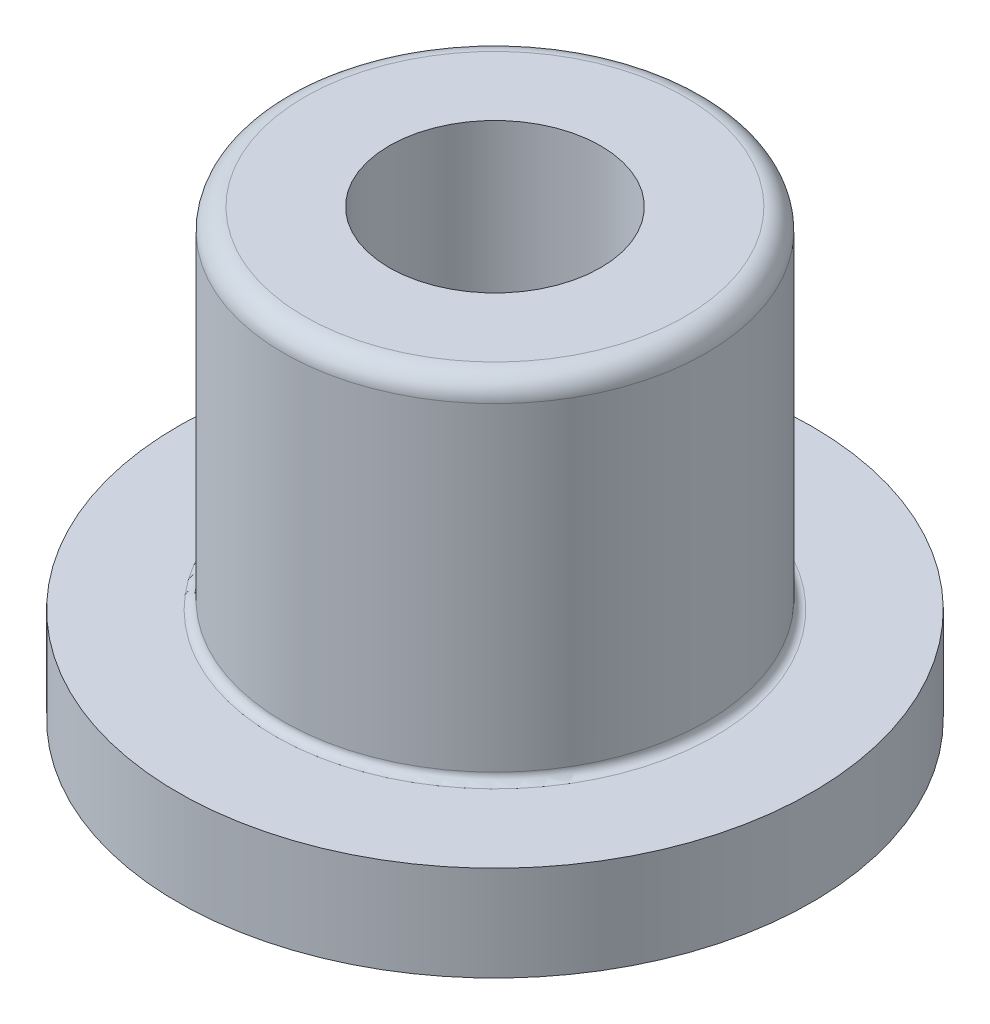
ISO-10303-21;
HEADER;
FILE_DESCRIPTION(('STEP AP214'),'2;1');
FILE_NAME('part.step','',(''),(''),'','','');
FILE_SCHEMA(('AUTOMOTIVE_DESIGN { 1 0 10303 214 1 1 1 1 }'));
ENDSEC;
DATA;
#1=APPLICATION_CONTEXT('core data for automotive mechanical design processes');
#2=APPLICATION_PROTOCOL_DEFINITION('international standard','automotive_design',2000,#1);
#3=PRODUCT_CONTEXT('',#1,'mechanical');
#4=PRODUCT('Part','Part','',(#3));
#5=PRODUCT_RELATED_PRODUCT_CATEGORY('part','',(#4));
#6=PRODUCT_DEFINITION_FORMATION('','',#4);
#7=PRODUCT_DEFINITION_CONTEXT('part definition',#1,'design');
#8=PRODUCT_DEFINITION('design','',#6,#7);
#9=PRODUCT_DEFINITION_SHAPE('','',#8);
#10=(LENGTH_UNIT() NAMED_UNIT(*) SI_UNIT(.MILLI.,.METRE.));
#11=(NAMED_UNIT(*) PLANE_ANGLE_UNIT() SI_UNIT($,.RADIAN.));
#12=(NAMED_UNIT(*) SI_UNIT($,.STERADIAN.) SOLID_ANGLE_UNIT());
#13=UNCERTAINTY_MEASURE_WITH_UNIT(LENGTH_MEASURE(1.E-05),#10,'distance_accuracy_value','');
#14=(GEOMETRIC_REPRESENTATION_CONTEXT(3) GLOBAL_UNCERTAINTY_ASSIGNED_CONTEXT((#13)) GLOBAL_UNIT_ASSIGNED_CONTEXT((#10,
#11,#12)) REPRESENTATION_CONTEXT('',''));
#15=CARTESIAN_POINT('',(0.,0.,0.));
#16=DIRECTION('',(0.,0.,1.));
#17=DIRECTION('',(1.,0.,0.));
#18=AXIS2_PLACEMENT_3D('',#15,#16,#17);
#19=CARTESIAN_POINT('',(0.,10.5,0.));
#20=DIRECTION('',(0.,-1.,0.));
#21=DIRECTION('',(0.,0.,-1.));
#22=AXIS2_PLACEMENT_3D('',#19,#20,#21);
#23=CYLINDRICAL_SURFACE('',#22,10.);
#24=CARTESIAN_POINT('',(0.,20.,0.));
#25=DIRECTION('',(0.,-1.,0.));
#26=DIRECTION('',(-0.479425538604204,0.,0.877582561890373));
#27=AXIS2_PLACEMENT_3D('',#24,#25,#26);
#28=CIRCLE('',#27,10.);
#29=CARTESIAN_POINT('',(-4.79425538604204,20.,8.77582561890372));
#30=VERTEX_POINT('',#29);
#31=EDGE_CURVE('E53',#30,#30,#28,.F.);
#32=ORIENTED_EDGE('',*,*,#31,.F.);
#33=EDGE_LOOP('',(#32));
#34=FACE_BOUND('',#33,.T.);
#35=CARTESIAN_POINT('',(0.,4.9,0.));
#36=DIRECTION('',(0.,-1.,0.));
#37=DIRECTION('',(0.197991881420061,0.,-0.9802036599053));
#38=AXIS2_PLACEMENT_3D('',#35,#36,#37);
#39=CIRCLE('',#38,10.);
#40=CARTESIAN_POINT('',(1.9799188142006,4.9,-9.80203659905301));
#41=VERTEX_POINT('',#40);
#42=EDGE_CURVE('E198',#41,#41,#39,.F.);
#43=ORIENTED_EDGE('',*,*,#42,.T.);
#44=EDGE_LOOP('',(#43));
#45=FACE_BOUND('',#44,.T.);
#46=ADVANCED_FACE('F17',(#34,#45),#23,.T.);
#47=CARTESIAN_POINT('',(0.,4.9,0.));
#48=DIRECTION('',(0.,-1.,0.));
#49=DIRECTION('',(0.197991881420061,0.,-0.9802036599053));
#50=AXIS2_PLACEMENT_3D('',#47,#48,#49);
#51=TOROIDAL_SURFACE('',#50,10.4,0.4);
#52=ORIENTED_EDGE('',*,*,#42,.F.);
#53=EDGE_LOOP('',(#52));
#54=FACE_BOUND('',#53,.T.);
#55=CARTESIAN_POINT('',(0.,4.5,0.));
#56=DIRECTION('',(0.,1.,0.));
#57=DIRECTION('',(-0.479425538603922,0.,0.877582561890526));
#58=AXIS2_PLACEMENT_3D('',#55,#56,#57);
#59=CIRCLE('',#58,10.3999999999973);
#60=CARTESIAN_POINT('',(-4.98602560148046,4.5,9.12685864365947));
#61=VERTEX_POINT('',#60);
#62=CARTESIAN_POINT('',(4.98602580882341,4.5,-9.12685853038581));
#63=VERTEX_POINT('',#62);
#64=EDGE_CURVE('E46',#61,#63,#59,.T.);
#65=ORIENTED_EDGE('',*,*,#64,.T.);
#66=CARTESIAN_POINT('',(4.98602594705,4.5,-9.12685845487));
#67=CARTESIAN_POINT('',(4.83668965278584,4.5,-9.2084453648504));
#68=CARTESIAN_POINT('',(4.6853478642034,4.5,-9.28636060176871));
#69=CARTESIAN_POINT('',(4.37902480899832,4.5,-9.43467430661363));
#70=CARTESIAN_POINT('',(4.22404354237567,4.5,-9.50507277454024));
#71=CARTESIAN_POINT('',(3.91081304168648,4.5,-9.63817951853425));
#72=CARTESIAN_POINT('',(3.75256380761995,4.5,-9.70088779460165));
#73=CARTESIAN_POINT('',(3.43317910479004,4.5,-9.8184641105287));
#74=CARTESIAN_POINT('',(3.27204363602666,4.5,-9.87333215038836));
#75=CARTESIAN_POINT('',(2.94727452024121,4.5,-9.97509553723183));
#76=CARTESIAN_POINT('',(2.78364087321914,4.5,-10.0219908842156));
#77=CARTESIAN_POINT('',(2.45426964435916,4.5,-10.1076959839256));
#78=CARTESIAN_POINT('',(2.28853206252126,4.5,-10.1465057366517));
#79=CARTESIAN_POINT('',(1.95535223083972,4.5,-10.2159461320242));
#80=CARTESIAN_POINT('',(1.78790998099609,4.5,-10.2465767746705));
#81=CARTESIAN_POINT('',(1.4517241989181,4.5,-10.2995851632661));
#82=CARTESIAN_POINT('',(1.28298066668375,4.5,-10.3219629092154));
#83=CARTESIAN_POINT('',(0.944598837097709,4.5,-10.3584115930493));
#84=CARTESIAN_POINT('',(0.774960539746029,4.5,-10.372482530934));
#85=CARTESIAN_POINT('',(0.435197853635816,4.5,-10.3922837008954));
#86=CARTESIAN_POINT('',(0.265073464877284,4.5,-10.3980139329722));
#87=CARTESIAN_POINT('',(-0.0752515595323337,4.5,-10.401119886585));
#88=CARTESIAN_POINT('',(-0.245452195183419,4.5,-10.398495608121));
#89=CARTESIAN_POINT('',(-0.585519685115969,4.5,-10.3848988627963));
#90=CARTESIAN_POINT('',(-0.755386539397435,4.5,-10.3739263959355));
#91=CARTESIAN_POINT('',(-1.09437724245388,4.5,-10.3436597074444));
#92=CARTESIAN_POINT('',(-1.26350109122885,4.5,-10.324365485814));
#93=CARTESIAN_POINT('',(-1.60059834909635,4.5,-10.2775017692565));
#94=CARTESIAN_POINT('',(-1.76857175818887,4.5,-10.2499322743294));
#95=CARTESIAN_POINT('',(-2.10296347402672,4.5,-10.1865844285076));
#96=CARTESIAN_POINT('',(-2.26938178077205,4.5,-10.1508060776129));
#97=CARTESIAN_POINT('',(-2.60026237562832,4.5,-10.0711267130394));
#98=CARTESIAN_POINT('',(-2.76472466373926,4.5,-10.0272256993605));
#99=CARTESIAN_POINT('',(-3.09129701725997,4.5,-9.93140677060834));
#100=CARTESIAN_POINT('',(-3.25340708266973,4.5,-9.87948885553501));
#101=CARTESIAN_POINT('',(-3.57488445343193,4.5,-9.76776119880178));
#102=CARTESIAN_POINT('',(-3.73425175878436,4.5,-9.70795145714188));
#103=CARTESIAN_POINT('',(-4.04985967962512,4.5,-9.58058423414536));
#104=CARTESIAN_POINT('',(-4.20610029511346,4.5,-9.51302675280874));
#105=CARTESIAN_POINT('',(-4.51507843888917,4.5,-9.37032680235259));
#106=CARTESIAN_POINT('',(-4.66781596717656,4.5,-9.29518433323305));
#107=CARTESIAN_POINT('',(-4.96941997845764,4.5,-9.13749543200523));
#108=CARTESIAN_POINT('',(-5.11828646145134,4.5,-9.05494899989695));
#109=CARTESIAN_POINT('',(-5.41178974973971,4.5,-8.88265103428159));
#110=CARTESIAN_POINT('',(-5.55642655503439,4.5,-8.79289950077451));
#111=CARTESIAN_POINT('',(-5.84112204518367,4.5,-8.60640755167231));
#112=CARTESIAN_POINT('',(-5.98118073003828,4.5,-8.50966713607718));
#113=CARTESIAN_POINT('',(-6.2563825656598,4.5,-8.30943047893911));
#114=CARTESIAN_POINT('',(-6.3915257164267,4.5,-8.20593423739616));
#115=CARTESIAN_POINT('',(-6.65657091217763,4.5,-7.99243525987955));
#116=CARTESIAN_POINT('',(-6.78647295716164,4.5,-7.88243252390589));
#117=CARTESIAN_POINT('',(-7.04072299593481,4.5,-7.65618556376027));
#118=CARTESIAN_POINT('',(-7.16507098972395,4.5,-7.53994133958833));
#119=CARTESIAN_POINT('',(-7.40791336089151,4.5,-7.30149144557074));
#120=CARTESIAN_POINT('',(-7.52640773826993,4.5,-7.17928577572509));
#121=CARTESIAN_POINT('',(-7.75725741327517,4.5,-6.92920739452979));
#122=CARTESIAN_POINT('',(-7.86961271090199,4.5,-6.80133468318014));
#123=CARTESIAN_POINT('',(-8.08791355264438,4.5,-6.54023027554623));
#124=CARTESIAN_POINT('',(-8.19385909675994,4.5,-6.40699857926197));
#125=CARTESIAN_POINT('',(-8.39908519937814,4.5,-6.13549716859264));
#126=CARTESIAN_POINT('',(-8.49836575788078,4.5,-5.99722745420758));
#127=CARTESIAN_POINT('',(-8.69002271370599,4.5,-5.71598311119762));
#128=CARTESIAN_POINT('',(-8.78239911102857,4.5,-5.57300848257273));
#129=CARTESIAN_POINT('',(-8.96002520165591,4.5,-5.28269874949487));
#130=CARTESIAN_POINT('',(-9.04527489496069,4.5,-5.13536364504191));
#131=CARTESIAN_POINT('',(-9.20844220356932,4.5,-4.83668790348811));
#132=CARTESIAN_POINT('',(-9.28635981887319,4.5,-4.68534726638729));
#133=CARTESIAN_POINT('',(-9.43467526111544,4.5,-4.37902505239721));
#134=CARTESIAN_POINT('',(-9.50507308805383,4.5,-4.22404347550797));
#135=CARTESIAN_POINT('',(-9.63817935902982,4.5,-3.91081274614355));
#136=CARTESIAN_POINT('',(-9.70088780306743,4.5,-3.75256359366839));
#137=CARTESIAN_POINT('',(-9.81846423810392,4.5,-3.43317894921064));
#138=CARTESIAN_POINT('',(-9.8733322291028,4.5,-3.27204345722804));
#139=CARTESIAN_POINT('',(-9.97509557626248,4.5,-2.94727432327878));
#140=CARTESIAN_POINT('',(-10.0219909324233,4.5,-2.7836406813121));
#141=CARTESIAN_POINT('',(-10.1076960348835,4.5,-2.45426945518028));
#142=CARTESIAN_POINT('',(-10.146505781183,4.5,-2.28853187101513));
#143=CARTESIAN_POINT('',(-10.2159461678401,4.5,-1.95535203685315));
#144=CARTESIAN_POINT('',(-10.2465768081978,4.5,-1.7879097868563));
#145=CARTESIAN_POINT('',(-10.299585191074,4.5,-1.45172400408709));
#146=CARTESIAN_POINT('',(-10.3219629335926,4.5,-1.28298047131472));
#147=CARTESIAN_POINT('',(-10.3584116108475,4.5,-0.944598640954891));
#148=CARTESIAN_POINT('',(-10.3724825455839,4.5,-0.774960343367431));
#149=CARTESIAN_POINT('',(-10.3922837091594,4.5,-0.435197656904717));
#150=CARTESIAN_POINT('',(-10.3980139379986,4.5,-0.265073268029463));
#151=CARTESIAN_POINT('',(-10.4011198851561,4.5,0.0752517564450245));
#152=CARTESIAN_POINT('',(-10.3984956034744,4.5,0.245452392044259));
#153=CARTESIAN_POINT('',(-10.384898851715,4.5,0.585519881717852));
#154=CARTESIAN_POINT('',(-10.3739263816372,4.5,0.755386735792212));
#155=CARTESIAN_POINT('',(-10.3436596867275,4.5,1.09437743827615));
#156=CARTESIAN_POINT('',(-10.3243654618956,4.5,1.26350128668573));
#157=CARTESIAN_POINT('',(-10.2775017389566,4.5,1.60059854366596));
#158=CARTESIAN_POINT('',(-10.2499322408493,4.5,1.76857195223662));
#159=CARTESIAN_POINT('',(-10.1865843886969,4.5,2.10296366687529));
#160=CARTESIAN_POINT('',(-10.1508060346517,4.5,2.2693819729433));
#161=CARTESIAN_POINT('',(-10.0711266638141,4.5,2.60026256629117));
#162=CARTESIAN_POINT('',(-10.0272256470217,4.5,2.76472485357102));
#163=CARTESIAN_POINT('',(-9.93140671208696,4.5,3.09129720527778));
#164=CARTESIAN_POINT('',(-9.87948879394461,4.5,3.25340726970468));
#165=CARTESIAN_POINT('',(-9.76776113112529,4.5,3.57488463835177));
#166=CARTESIAN_POINT('',(-9.70795138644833,4.5,3.73425194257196));
#167=CARTESIAN_POINT('',(-9.58058415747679,4.5,4.04985986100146));
#168=CARTESIAN_POINT('',(-9.51302667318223,4.5,4.20610047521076));
#169=CARTESIAN_POINT('',(-9.37032671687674,4.5,4.51507861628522));
#170=CARTESIAN_POINT('',(-9.29518424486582,4.5,4.66781614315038));
#171=CARTESIAN_POINT('',(-9.13749533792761,4.5,4.96942015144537));
#172=CARTESIAN_POINT('',(-9.05494890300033,4.5,5.11828663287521));
#173=CARTESIAN_POINT('',(-8.88265093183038,4.5,5.41178991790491));
#174=CARTESIAN_POINT('',(-8.79289939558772,4.5,5.55642672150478));
#175=CARTESIAN_POINT('',(-8.60640744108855,4.5,5.84112220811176));
#176=CARTESIAN_POINT('',(-8.50966702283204,4.5,5.98118089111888));
#177=CARTESIAN_POINT('',(-8.30943036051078,4.5,6.25638272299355));
#178=CARTESIAN_POINT('',(-8.20593411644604,4.5,6.3915258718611));
#179=CARTESIAN_POINT('',(-7.99243513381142,4.5,6.65657106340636));
#180=CARTESIAN_POINT('',(-7.88243239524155,4.5,6.78647310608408));
#181=CARTESIAN_POINT('',(-7.65618543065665,4.5,7.0407231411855));
#182=CARTESIAN_POINT('',(-7.53994120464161,4.5,7.1650711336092));
#183=CARTESIAN_POINT('',(-7.30149130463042,4.5,7.4079134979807));
#184=CARTESIAN_POINT('',(-7.17928563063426,4.5,7.52640786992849));
#185=CARTESIAN_POINT('',(-6.92920725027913,4.5,7.75725754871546));
#186=CARTESIAN_POINT('',(-6.80133454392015,4.5,7.86961285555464));
#187=CARTESIAN_POINT('',(-6.54023011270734,4.5,8.08791366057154));
#188=CARTESIAN_POINT('',(-6.4069983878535,4.5,8.19385915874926));
#189=CARTESIAN_POINT('',(-6.13549704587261,4.5,8.39908537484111));
#190=CARTESIAN_POINT('',(-5.99722742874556,4.5,8.49836609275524));
#191=CARTESIAN_POINT('',(-5.7159828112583,4.5,8.69002260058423));
#192=CARTESIAN_POINT('',(-5.57300781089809,4.5,8.7823983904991));
#193=CARTESIAN_POINT('',(-5.28269908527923,4.5,8.96002612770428));
#194=CARTESIAN_POINT('',(-5.13536536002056,4.5,9.0452780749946));
#195=CARTESIAN_POINT('',(-4.98602560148,4.5,9.12685864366));
#196=B_SPLINE_CURVE_WITH_KNOTS('',3,(#66,#67,#68,#69,#70,#71,#72,#73,#74,#75,#76,#77,#78,#79,
#80,#81,#82,#83,#84,#85,#86,#87,#88,#89,#90,#91,#92,#93,#94,#95,#96,#97,#98,#99,#100,#101,#102,
#103,#104,#105,#106,#107,#108,#109,#110,#111,#112,#113,#114,#115,#116,#117,#118,#119,#120,#121,
#122,#123,#124,#125,#126,#127,#128,#129,#130,#131,#132,#133,#134,#135,#136,#137,#138,#139,#140,
#141,#142,#143,#144,#145,#146,#147,#148,#149,#150,#151,#152,#153,#154,#155,#156,#157,#158,#159,
#160,#161,#162,#163,#164,#165,#166,#167,#168,#169,#170,#171,#172,#173,#174,#175,#176,#177,#178,
#179,#180,#181,#182,#183,#184,#185,#186,#187,#188,#189,#190,#191,#192,#193,#194,#195),
.UNSPECIFIED.,.F.,.F.,(4,2,2,2,2,2,2,2,2,2,2,2,2,2,2,2,2,2,2,2,2,2,2,2,2,2,2,2,2,2,2,2,2,2,2,2,
2,2,2,2,2,2,2,2,2,2,2,2,2,2,2,2,2,2,2,2,2,2,2,2,2,2,2,2,4),(0.,0.510457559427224,
1.02091511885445,1.53137267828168,2.04183023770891,2.55228779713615,3.06274535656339,
3.57320291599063,4.08366047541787,4.59411803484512,5.10457559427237,5.61503315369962,
6.12549071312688,6.63594827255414,7.1464058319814,7.65686339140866,8.16732095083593,
8.6777785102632,9.18823606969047,9.69869362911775,10.209151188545,10.7196087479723,
11.2300663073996,11.7405238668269,12.2509814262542,12.7614389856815,13.2718965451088,
13.7823541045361,14.2928116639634,14.8032692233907,15.313726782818,15.8241843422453,
16.3346419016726,16.8450994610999,17.3555570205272,17.8660145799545,18.3764721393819,
18.8869296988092,19.3973872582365,19.9078448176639,20.4183023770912,20.9287599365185,
21.4392174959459,21.9496750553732,22.4601326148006,22.9705901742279,23.4810477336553,
23.9915052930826,24.50196285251,25.0124204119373,25.5228779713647,26.0333355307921,
26.5437930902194,27.0542506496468,27.5647082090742,28.0751657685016,28.585623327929,
29.0960808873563,29.6065384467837,30.1169960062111,30.6274535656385,31.1379111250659,
31.6483686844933,32.1588262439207,32.6692838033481),.UNSPECIFIED.);
#197=EDGE_CURVE('E49',#63,#61,#196,.T.);
#198=ORIENTED_EDGE('',*,*,#197,.T.);
#199=EDGE_LOOP('',(#65,#198));
#200=FACE_BOUND('',#199,.T.);
#201=ADVANCED_FACE('F50',(#54,#200),#51,.F.);
#202=CARTESIAN_POINT('',(0.,20.,0.));
#203=DIRECTION('',(0.,-1.,0.));
#204=DIRECTION('',(-0.479425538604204,0.,0.877582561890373));
#205=AXIS2_PLACEMENT_3D('',#202,#203,#204);
#206=TOROIDAL_SURFACE('',#205,9.,1.);
#207=CARTESIAN_POINT('',(4.31482979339,21.,-7.89824308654));
#208=CARTESIAN_POINT('',(4.44406612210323,21.,-7.82764451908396));
#209=CARTESIAN_POINT('',(4.57156646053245,21.,-7.75386879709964));
#210=CARTESIAN_POINT('',(4.82279516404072,21.,-7.60015248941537));
#211=CARTESIAN_POINT('',(4.94652352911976,21.,-7.52021190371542));
#212=CARTESIAN_POINT('',(5.18990829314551,21.,-7.35435531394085));
#213=CARTESIAN_POINT('',(5.30956469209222,21.,-7.26843930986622));
#214=CARTESIAN_POINT('',(5.54451777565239,21.,-7.09083970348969));
#215=CARTESIAN_POINT('',(5.65981446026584,21.,-6.99915610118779));
#216=CARTESIAN_POINT('',(5.88577021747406,21.,-6.81024194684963));
#217=CARTESIAN_POINT('',(5.99642929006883,21.,-6.71301139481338));
#218=CARTESIAN_POINT('',(6.21284327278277,21.,-6.51323763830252));
#219=CARTESIAN_POINT('',(6.31859818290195,21.,-6.41069443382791));
#220=CARTESIAN_POINT('',(6.52494905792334,21.,-6.20054239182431));
#221=CARTESIAN_POINT('',(6.62554502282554,21.,-6.0929335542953));
#222=CARTESIAN_POINT('',(6.82133566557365,21.,-5.87290948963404));
#223=CARTESIAN_POINT('',(6.91653034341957,21.,-5.76049426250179));
#224=CARTESIAN_POINT('',(7.10128907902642,21.,-5.53112823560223));
#225=CARTESIAN_POINT('',(7.19085313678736,21.,-5.41417743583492));
#226=CARTESIAN_POINT('',(7.36413486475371,21.,-5.17602200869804));
#227=CARTESIAN_POINT('',(7.44785253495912,21.,-5.05481738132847));
#228=CARTESIAN_POINT('',(7.60923980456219,21.,-4.80844629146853));
#229=CARTESIAN_POINT('',(7.68690940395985,21.,-4.68327982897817));
#230=CARTESIAN_POINT('',(7.83601341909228,21.,-4.42928660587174));
#231=CARTESIAN_POINT('',(7.90744783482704,21.,-4.30045984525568));
#232=CARTESIAN_POINT('',(8.04390939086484,21.,-4.03945638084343));
#233=CARTESIAN_POINT('',(8.10893653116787,21.,-3.90727967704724));
#234=CARTESIAN_POINT('',(8.23242688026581,21.,-3.6398947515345));
#235=CARTESIAN_POINT('',(8.29089008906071,21.,-3.50468652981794));
#236=CARTESIAN_POINT('',(8.40111173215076,21.,-3.23156429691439));
#237=CARTESIAN_POINT('',(8.4528701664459,21.,-3.0936502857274));
#238=CARTESIAN_POINT('',(8.54955756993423,21.,-2.81544872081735));
#239=CARTESIAN_POINT('',(8.59448653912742,21.,-2.67516116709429));
#240=CARTESIAN_POINT('',(8.67740677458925,21.,-2.39255048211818));
#241=CARTESIAN_POINT('',(8.71539804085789,21.,-2.25022735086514));
#242=CARTESIAN_POINT('',(8.78435134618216,21.,-1.9638883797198));
#243=CARTESIAN_POINT('',(8.81531338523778,21.,-1.81987253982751));
#244=CARTESIAN_POINT('',(8.87013364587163,21.,-1.53049509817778));
#245=CARTESIAN_POINT('',(8.89399186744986,21.,-1.38513349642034));
#246=CARTESIAN_POINT('',(8.93454701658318,21.,-1.09341471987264));
#247=CARTESIAN_POINT('',(8.95124394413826,21.,-0.947057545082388));
#248=CARTESIAN_POINT('',(8.97743628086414,21.,-0.653700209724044));
#249=CARTESIAN_POINT('',(8.98693169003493,21.,-0.506700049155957));
#250=CARTESIAN_POINT('',(8.99869811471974,21.,-0.212410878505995));
#251=CARTESIAN_POINT('',(9.00096913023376,21.,-0.0651218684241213));
#252=CARTESIAN_POINT('',(8.99828129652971,21.,0.229390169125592));
#253=CARTESIAN_POINT('',(8.99332244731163,21.,0.376613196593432));
#254=CARTESIAN_POINT('',(8.97618683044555,21.,0.670638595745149));
#255=CARTESIAN_POINT('',(8.96401006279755,21.,0.817440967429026));
#256=CARTESIAN_POINT('',(8.93246794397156,21.,1.11027139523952));
#257=CARTESIAN_POINT('',(8.91310259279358,21.,1.25629945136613));
#258=CARTESIAN_POINT('',(8.86722995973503,21.,1.5472294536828));
#259=CARTESIAN_POINT('',(8.84072267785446,21.,1.69213139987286));
#260=CARTESIAN_POINT('',(8.78063004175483,21.,1.98046010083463));
#261=CARTESIAN_POINT('',(8.74704468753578,21.,2.12388685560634));
#262=CARTESIAN_POINT('',(8.67287681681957,21.,2.40891964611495));
#263=CARTESIAN_POINT('',(8.63229430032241,21.,2.55052568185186));
#264=CARTESIAN_POINT('',(8.54422987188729,21.,2.83157589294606));
#265=CARTESIAN_POINT('',(8.49674795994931,21.,2.97102006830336));
#266=CARTESIAN_POINT('',(8.39499912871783,21.,3.24741062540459));
#267=CARTESIAN_POINT('',(8.34073220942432,21.,3.38435700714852));
#268=CARTESIAN_POINT('',(8.22554409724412,21.,3.65542206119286));
#269=CARTESIAN_POINT('',(8.16462290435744,21.,3.78954073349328));
#270=CARTESIAN_POINT('',(8.03627300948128,21.,4.05462726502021));
#271=CARTESIAN_POINT('',(7.96884430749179,21.,4.18559512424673));
#272=CARTESIAN_POINT('',(7.82764183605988,21.,4.44406451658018));
#273=CARTESIAN_POINT('',(7.75386806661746,21.,4.57156604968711));
#274=CARTESIAN_POINT('',(7.60015318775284,21.,4.82279562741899));
#275=CARTESIAN_POINT('',(7.52021207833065,21.,4.94652367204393));
#276=CARTESIAN_POINT('',(7.35435510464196,21.,5.18990820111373));
#277=CARTESIAN_POINT('',(7.26843924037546,21.,5.30956468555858));
#278=CARTESIAN_POINT('',(7.0908397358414,21.,5.54451783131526));
#279=CARTESIAN_POINT('',(6.99915609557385,21.,5.65981449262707));
#280=CARTESIAN_POINT('',(6.81024191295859,21.,5.88577023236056));
#281=CARTESIAN_POINT('',(6.71301137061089,21.,5.99642931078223));
#282=CARTESIAN_POINT('',(6.51323762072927,21.,6.21284329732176));
#283=CARTESIAN_POINT('',(6.41069441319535,21.,6.31859820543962));
#284=CARTESIAN_POINT('',(6.20054236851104,21.,6.52494907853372));
#285=CARTESIAN_POINT('',(6.09293353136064,21.,6.62554504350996));
#286=CARTESIAN_POINT('',(5.87290946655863,21.,6.82133568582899));
#287=CARTESIAN_POINT('',(5.760494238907,21.,6.91653036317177));
#288=CARTESIAN_POINT('',(5.53112821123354,21.,7.10128909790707));
#289=CARTESIAN_POINT('',(5.4141774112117,21.,7.19085315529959));
#290=CARTESIAN_POINT('',(5.17602198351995,21.,7.36413488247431));
#291=CARTESIAN_POINT('',(5.05481735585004,21.,7.44785255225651));
#292=CARTESIAN_POINT('',(4.80844626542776,21.,7.60923982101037));
#293=CARTESIAN_POINT('',(4.68327980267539,21.,7.68690941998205));
#294=CARTESIAN_POINT('',(4.42928657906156,21.,7.83601343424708));
#295=CARTESIAN_POINT('',(4.3004598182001,21.,7.90744784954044));
#296=CARTESIAN_POINT('',(4.03945635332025,21.,8.04390940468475));
#297=CARTESIAN_POINT('',(3.90727964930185,21.,8.10893654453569));
#298=CARTESIAN_POINT('',(3.6398947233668,21.,8.23242689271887));
#299=CARTESIAN_POINT('',(3.50468650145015,21.,8.29089010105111));
#300=CARTESIAN_POINT('',(3.23156426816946,21.,8.40111174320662));
#301=CARTESIAN_POINT('',(3.09365025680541,21.,8.4528701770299));
#302=CARTESIAN_POINT('',(2.81544869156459,21.,8.54955757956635));
#303=CARTESIAN_POINT('',(2.67516113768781,21.,8.59448654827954));
#304=CARTESIAN_POINT('',(2.39255045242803,21.,8.6774067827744));
#305=CARTESIAN_POINT('',(2.25022732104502,21.,8.71539804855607));
#306=CARTESIAN_POINT('',(1.96388834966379,21.,8.78435135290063));
#307=CARTESIAN_POINT('',(1.81987250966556,21.,8.81531339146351));
#308=CARTESIAN_POINT('',(1.53049506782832,21.,8.8701336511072));
#309=CARTESIAN_POINT('',(1.3851334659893,21.,8.89399187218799));
#310=CARTESIAN_POINT('',(1.09341468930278,21.,8.93454702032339));
#311=CARTESIAN_POINT('',(0.947057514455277,21.,8.95124394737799));
#312=CARTESIAN_POINT('',(0.653700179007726,21.,8.97743628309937));
#313=CARTESIAN_POINT('',(0.506700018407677,21.,8.98693169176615));
#314=CARTESIAN_POINT('',(0.212410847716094,21.,8.99869811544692));
#315=CARTESIAN_POINT('',(0.0651218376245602,21.,9.00096913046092));
#316=CARTESIAN_POINT('',(-0.229390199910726,21.,8.99828129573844));
#317=CARTESIAN_POINT('',(-0.376613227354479,21.,8.99332244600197));
#318=CARTESIAN_POINT('',(-0.670638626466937,21.,8.97618682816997));
#319=CARTESIAN_POINT('',(-0.817440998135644,21.,8.96401006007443));
#320=CARTESIAN_POINT('',(-1.11027142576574,21.,8.93246794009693));
#321=CARTESIAN_POINT('',(-1.25629948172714,21.,8.91310258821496));
#322=CARTESIAN_POINT('',(-1.54722948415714,21.,8.8672299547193));
#323=CARTESIAN_POINT('',(-1.69213143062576,21.,8.84072267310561));
#324=CARTESIAN_POINT('',(-1.98046013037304,21.,8.78063003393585));
#325=CARTESIAN_POINT('',(-2.12388688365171,21.,8.74704467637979));
#326=CARTESIAN_POINT('',(-2.40891967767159,21.,8.6728768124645));
#327=CARTESIAN_POINT('',(-2.5505257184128,21.,8.63229430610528));
#328=CARTESIAN_POINT('',(-2.83157591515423,21.,8.54422984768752));
#329=CARTESIAN_POINT('',(-2.97102007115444,21.,8.49674789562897));
#330=CARTESIAN_POINT('',(-3.24741068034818,21.,8.39499917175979));
#331=CARTESIAN_POINT('',(-3.38435713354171,21.,8.34073239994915));
#332=CARTESIAN_POINT('',(-3.65542199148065,21.,8.22554388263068));
#333=CARTESIAN_POINT('',(-3.78954039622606,21.,8.16462213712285));
#334=CARTESIAN_POINT('',(-4.05462765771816,21.,8.03627374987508));
#335=CARTESIAN_POINT('',(-4.18559651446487,21.,7.96884710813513));
#336=CARTESIAN_POINT('',(-4.31482984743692,21.,7.89824305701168));
#337=B_SPLINE_CURVE_WITH_KNOTS('',3,(#207,#208,#209,#210,#211,#212,#213,#214,#215,#216,#217,
#218,#219,#220,#221,#222,#223,#224,#225,#226,#227,#228,#229,#230,#231,#232,#233,#234,#235,#236,
#237,#238,#239,#240,#241,#242,#243,#244,#245,#246,#247,#248,#249,#250,#251,#252,#253,#254,#255,
#256,#257,#258,#259,#260,#261,#262,#263,#264,#265,#266,#267,#268,#269,#270,#271,#272,#273,#274,
#275,#276,#277,#278,#279,#280,#281,#282,#283,#284,#285,#286,#287,#288,#289,#290,#291,#292,#293,
#294,#295,#296,#297,#298,#299,#300,#301,#302,#303,#304,#305,#306,#307,#308,#309,#310,#311,#312,
#313,#314,#315,#316,#317,#318,#319,#320,#321,#322,#323,#324,#325,#326,#327,#328,#329,#330,#331,
#332,#333,#334,#335,#336),.UNSPECIFIED.,.F.,.F.,(4,2,2,2,2,2,2,2,2,2,2,2,2,2,2,2,2,2,2,2,2,2,2,
2,2,2,2,2,2,2,2,2,2,2,2,2,2,2,2,2,2,2,2,2,2,2,2,2,2,2,2,2,2,2,2,2,2,2,2,2,2,2,2,2,4),(0.,
0.441742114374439,0.883484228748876,1.32522634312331,1.76696845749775,2.20871057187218,
2.65045268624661,3.09219480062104,3.53393691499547,3.9756790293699,4.41742114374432,
4.85916325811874,5.30090537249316,5.74264748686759,6.184389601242,6.62613171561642,
7.06787382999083,7.50961594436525,7.95135805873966,8.39310017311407,8.83484228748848,
9.27658440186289,9.71832651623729,10.1600686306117,10.6018107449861,11.0435528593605,
11.4852949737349,11.9270370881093,12.3687792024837,12.8105213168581,13.2522634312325,
13.6940055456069,14.1357476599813,14.5774897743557,15.01923188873,15.4609740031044,
15.9027161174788,16.3444582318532,16.7862003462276,17.227942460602,17.6696845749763,
18.1114266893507,18.5531688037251,18.9949109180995,19.4366530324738,19.8783951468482,
20.3201372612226,20.7618793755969,21.2036214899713,21.6453636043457,22.08710571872,
22.5288478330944,22.9705899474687,23.4123320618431,23.8540741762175,24.2958162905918,
24.7375584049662,25.1793005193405,25.6210426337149,26.0627847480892,26.5045268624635,
26.9462689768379,27.3880110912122,27.8297532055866,28.2714953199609),.UNSPECIFIED.);
#338=CARTESIAN_POINT('',(4.31482980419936,21.,-7.8982430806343));
#339=VERTEX_POINT('',#338);
#340=CARTESIAN_POINT('',(-4.31482984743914,21.,7.89824305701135));
#341=VERTEX_POINT('',#340);
#342=EDGE_CURVE('E37',#339,#341,#337,.T.);
#343=ORIENTED_EDGE('',*,*,#342,.T.);
#344=CARTESIAN_POINT('',(0.,21.,0.));
#345=DIRECTION('',(0.,-1.,0.));
#346=DIRECTION('',(-0.479425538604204,0.,0.877582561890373));
#347=AXIS2_PLACEMENT_3D('',#344,#345,#346);
#348=CIRCLE('',#347,8.99999999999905);
#349=EDGE_CURVE('E100',#341,#339,#348,.T.);
#350=ORIENTED_EDGE('',*,*,#349,.T.);
#351=EDGE_LOOP('',(#343,#350));
#352=FACE_BOUND('',#351,.T.);
#353=ORIENTED_EDGE('',*,*,#31,.T.);
#354=EDGE_LOOP('',(#353));
#355=FACE_BOUND('',#354,.T.);
#356=ADVANCED_FACE('F77',(#352,#355),#206,.T.);
#357=CARTESIAN_POINT('',(0.,4.5,10.));
#358=DIRECTION('',(0.,-1.,0.));
#359=DIRECTION('',(0.,0.,-1.));
#360=AXIS2_PLACEMENT_3D('',#357,#358,#359);
#361=PLANE('',#360);
#362=ORIENTED_EDGE('',*,*,#197,.F.);
#363=ORIENTED_EDGE('',*,*,#64,.F.);
#364=EDGE_LOOP('',(#362,#363));
#365=FACE_BOUND('',#364,.T.);
#366=CARTESIAN_POINT('',(0.,4.5,0.));
#367=DIRECTION('',(0.,-1.,0.));
#368=DIRECTION('',(0.,0.,-1.));
#369=AXIS2_PLACEMENT_3D('',#366,#367,#368);
#370=CIRCLE('',#369,15.);
#371=CARTESIAN_POINT('',(0.,4.5,-15.));
#372=VERTEX_POINT('',#371);
#373=EDGE_CURVE('E148',#372,#372,#370,.T.);
#374=ORIENTED_EDGE('',*,*,#373,.F.);
#375=EDGE_LOOP('',(#374));
#376=FACE_BOUND('',#375,.T.);
#377=ADVANCED_FACE('F56',(#365,#376),#361,.F.);
#378=CARTESIAN_POINT('',(0.,21.,0.));
#379=DIRECTION('',(0.,-1.,0.));
#380=DIRECTION('',(0.,0.,-1.));
#381=AXIS2_PLACEMENT_3D('',#378,#379,#380);
#382=PLANE('',#381);
#383=CARTESIAN_POINT('',(0.,21.,0.));
#384=DIRECTION('',(0.,-1.,0.));
#385=DIRECTION('',(0.,0.,-1.));
#386=AXIS2_PLACEMENT_3D('',#383,#384,#385);
#387=CIRCLE('',#386,5.);
#388=CARTESIAN_POINT('',(0.,21.,-5.00000000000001));
#389=VERTEX_POINT('',#388);
#390=EDGE_CURVE('E145',#389,#389,#387,.T.);
#391=ORIENTED_EDGE('',*,*,#390,.T.);
#392=EDGE_LOOP('',(#391));
#393=FACE_BOUND('',#392,.T.);
#394=ORIENTED_EDGE('',*,*,#342,.F.);
#395=ORIENTED_EDGE('',*,*,#349,.F.);
#396=EDGE_LOOP('',(#394,#395));
#397=FACE_BOUND('',#396,.T.);
#398=ADVANCED_FACE('F76',(#393,#397),#382,.F.);
#399=CARTESIAN_POINT('',(0.,10.5,0.));
#400=DIRECTION('',(0.,-1.,0.));
#401=DIRECTION('',(0.,0.,-1.));
#402=AXIS2_PLACEMENT_3D('',#399,#400,#401);
#403=CYLINDRICAL_SURFACE('',#402,15.);
#404=CARTESIAN_POINT('',(0.,0.,0.));
#405=DIRECTION('',(0.,-1.,0.));
#406=DIRECTION('',(0.,0.,-1.));
#407=AXIS2_PLACEMENT_3D('',#404,#405,#406);
#408=CIRCLE('',#407,15.);
#409=CARTESIAN_POINT('',(0.,0.,-15.));
#410=VERTEX_POINT('',#409);
#411=EDGE_CURVE('E29',#410,#410,#408,.T.);
#412=ORIENTED_EDGE('',*,*,#411,.F.);
#413=EDGE_LOOP('',(#412));
#414=FACE_BOUND('',#413,.T.);
#415=ORIENTED_EDGE('',*,*,#373,.T.);
#416=EDGE_LOOP('',(#415));
#417=FACE_BOUND('',#416,.T.);
#418=ADVANCED_FACE('F84',(#414,#417),#403,.T.);
#419=CARTESIAN_POINT('',(0.,20.9,0.));
#420=DIRECTION('',(0.,-1.,0.));
#421=DIRECTION('',(0.,0.,-1.));
#422=AXIS2_PLACEMENT_3D('',#419,#420,#421);
#423=CYLINDRICAL_SURFACE('',#422,5.);
#424=CARTESIAN_POINT('',(0.,0.,0.));
#425=DIRECTION('',(0.,-1.,0.));
#426=DIRECTION('',(0.,0.,-1.));
#427=AXIS2_PLACEMENT_3D('',#424,#425,#426);
#428=CIRCLE('',#427,5.);
#429=CARTESIAN_POINT('',(0.,0.,-5.00000000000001));
#430=VERTEX_POINT('',#429);
#431=EDGE_CURVE('E11',#430,#430,#428,.F.);
#432=ORIENTED_EDGE('',*,*,#431,.F.);
#433=EDGE_LOOP('',(#432));
#434=FACE_BOUND('',#433,.T.);
#435=ORIENTED_EDGE('',*,*,#390,.F.);
#436=EDGE_LOOP('',(#435));
#437=FACE_BOUND('',#436,.T.);
#438=ADVANCED_FACE('F134',(#434,#437),#423,.F.);
#439=CARTESIAN_POINT('',(0.,0.,15.));
#440=DIRECTION('',(0.,-1.,0.));
#441=DIRECTION('',(0.,0.,-1.));
#442=AXIS2_PLACEMENT_3D('',#439,#440,#441);
#443=PLANE('',#442);
#444=ORIENTED_EDGE('',*,*,#431,.T.);
#445=EDGE_LOOP('',(#444));
#446=FACE_BOUND('',#445,.T.);
#447=ORIENTED_EDGE('',*,*,#411,.T.);
#448=EDGE_LOOP('',(#447));
#449=FACE_BOUND('',#448,.T.);
#450=ADVANCED_FACE('F19',(#446,#449),#443,.T.);
#451=CLOSED_SHELL('',(#46,#201,#356,#377,#398,#418,#438,#450));
#452=MANIFOLD_SOLID_BREP('B1',#451);
#453=ADVANCED_BREP_SHAPE_REPRESENTATION('',(#18,#452),#14);
#454=SHAPE_DEFINITION_REPRESENTATION(#9,#453);
ENDSEC;
END-ISO-10303-21;
